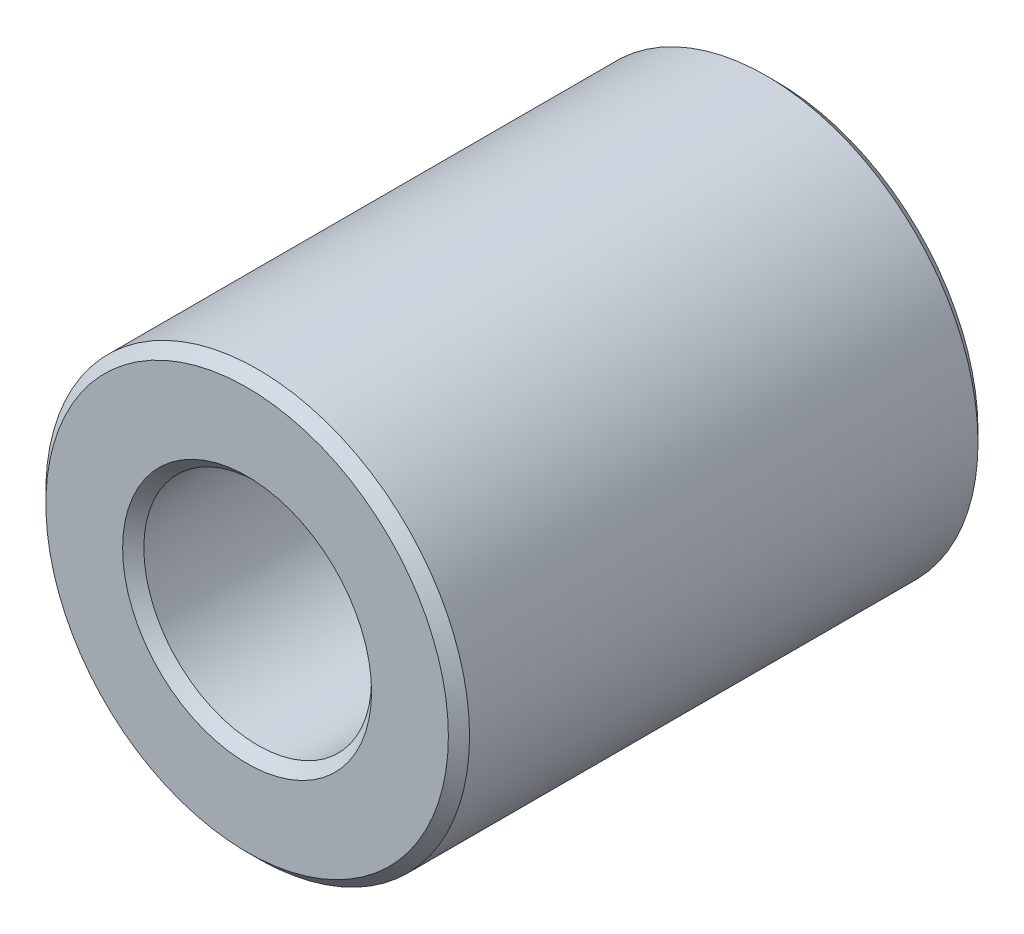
ISO-10303-21;
HEADER;
FILE_DESCRIPTION(('STEP AP214'),'2;1');
FILE_NAME('part.step','',(''),(''),'','','');
FILE_SCHEMA(('AUTOMOTIVE_DESIGN { 1 0 10303 214 1 1 1 1 }'));
ENDSEC;
DATA;
#1=APPLICATION_CONTEXT('core data for automotive mechanical design processes');
#2=APPLICATION_PROTOCOL_DEFINITION('international standard','automotive_design',2000,#1);
#3=PRODUCT_CONTEXT('',#1,'mechanical');
#4=PRODUCT('Part','Part','',(#3));
#5=PRODUCT_RELATED_PRODUCT_CATEGORY('part','',(#4));
#6=PRODUCT_DEFINITION_FORMATION('','',#4);
#7=PRODUCT_DEFINITION_CONTEXT('part definition',#1,'design');
#8=PRODUCT_DEFINITION('design','',#6,#7);
#9=PRODUCT_DEFINITION_SHAPE('','',#8);
#10=(LENGTH_UNIT() NAMED_UNIT(*) SI_UNIT(.MILLI.,.METRE.));
#11=(NAMED_UNIT(*) PLANE_ANGLE_UNIT() SI_UNIT($,.RADIAN.));
#12=(NAMED_UNIT(*) SI_UNIT($,.STERADIAN.) SOLID_ANGLE_UNIT());
#13=UNCERTAINTY_MEASURE_WITH_UNIT(LENGTH_MEASURE(1.E-05),#10,'distance_accuracy_value','');
#14=(GEOMETRIC_REPRESENTATION_CONTEXT(3) GLOBAL_UNCERTAINTY_ASSIGNED_CONTEXT((#13)) GLOBAL_UNIT_ASSIGNED_CONTEXT((#10,
#11,#12)) REPRESENTATION_CONTEXT('',''));
#15=CARTESIAN_POINT('',(0.,0.,0.));
#16=DIRECTION('',(0.,0.,1.));
#17=DIRECTION('',(1.,0.,0.));
#18=AXIS2_PLACEMENT_3D('',#15,#16,#17);
#19=CARTESIAN_POINT('',(0.,0.,5.));
#20=DIRECTION('',(0.,0.,1.));
#21=DIRECTION('',(1.,0.,0.));
#22=AXIS2_PLACEMENT_3D('',#19,#20,#21);
#23=PLANE('',#22);
#24=CARTESIAN_POINT('',(0.,0.,5.));
#25=DIRECTION('',(0.,0.,1.));
#26=DIRECTION('',(1.,0.,0.));
#27=AXIS2_PLACEMENT_3D('',#24,#25,#26);
#28=CIRCLE('',#27,2.35);
#29=CARTESIAN_POINT('',(2.35,0.,5.));
#30=VERTEX_POINT('',#29);
#31=EDGE_CURVE('E10',#30,#30,#28,.F.);
#32=ORIENTED_EDGE('',*,*,#31,.T.);
#33=EDGE_LOOP('',(#32));
#34=FACE_BOUND('',#33,.T.);
#35=CARTESIAN_POINT('',(0.,0.,5.));
#36=DIRECTION('',(0.,0.,1.));
#37=DIRECTION('',(1.,0.,0.));
#38=AXIS2_PLACEMENT_3D('',#35,#36,#37);
#39=CIRCLE('',#38,3.8);
#40=CARTESIAN_POINT('',(3.8,0.,5.));
#41=VERTEX_POINT('',#40);
#42=EDGE_CURVE('E45',#41,#41,#39,.T.);
#43=ORIENTED_EDGE('',*,*,#42,.T.);
#44=EDGE_LOOP('',(#43));
#45=FACE_BOUND('',#44,.T.);
#46=ADVANCED_FACE('F37',(#34,#45),#23,.T.);
#47=CARTESIAN_POINT('',(0.,0.,-5.));
#48=DIRECTION('',(0.,0.,1.));
#49=DIRECTION('',(1.,0.,0.));
#50=AXIS2_PLACEMENT_3D('',#47,#48,#49);
#51=PLANE('',#50);
#52=CARTESIAN_POINT('',(0.,0.,-5.));
#53=DIRECTION('',(0.,0.,1.));
#54=DIRECTION('',(1.,0.,0.));
#55=AXIS2_PLACEMENT_3D('',#52,#53,#54);
#56=CIRCLE('',#55,3.79999999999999);
#57=CARTESIAN_POINT('',(3.79999999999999,0.,-5.));
#58=VERTEX_POINT('',#57);
#59=EDGE_CURVE('E64',#58,#58,#56,.F.);
#60=ORIENTED_EDGE('',*,*,#59,.T.);
#61=EDGE_LOOP('',(#60));
#62=FACE_BOUND('',#61,.T.);
#63=CARTESIAN_POINT('',(0.,0.,-5.));
#64=DIRECTION('',(0.,0.,1.));
#65=DIRECTION('',(1.,0.,0.));
#66=AXIS2_PLACEMENT_3D('',#63,#64,#65);
#67=CIRCLE('',#66,2.35);
#68=CARTESIAN_POINT('',(2.35,0.,-5.));
#69=VERTEX_POINT('',#68);
#70=EDGE_CURVE('E67',#69,#69,#67,.T.);
#71=ORIENTED_EDGE('',*,*,#70,.T.);
#72=EDGE_LOOP('',(#71));
#73=FACE_BOUND('',#72,.T.);
#74=ADVANCED_FACE('F89',(#62,#73),#51,.F.);
#75=CARTESIAN_POINT('',(0.,0.,5.));
#76=DIRECTION('',(0.,0.,-1.));
#77=DIRECTION('',(-1.,0.,0.));
#78=AXIS2_PLACEMENT_3D('',#75,#76,#77);
#79=CYLINDRICAL_SURFACE('',#78,4.);
#80=CARTESIAN_POINT('',(0.,0.,-4.8));
#81=DIRECTION('',(0.,0.,1.));
#82=DIRECTION('',(1.,0.,0.));
#83=AXIS2_PLACEMENT_3D('',#80,#81,#82);
#84=CIRCLE('',#83,4.);
#85=CARTESIAN_POINT('',(4.,0.,-4.8));
#86=VERTEX_POINT('',#85);
#87=EDGE_CURVE('E71',#86,#86,#84,.T.);
#88=ORIENTED_EDGE('',*,*,#87,.T.);
#89=EDGE_LOOP('',(#88));
#90=FACE_BOUND('',#89,.T.);
#91=CARTESIAN_POINT('',(0.,0.,4.8));
#92=DIRECTION('',(0.,0.,1.));
#93=DIRECTION('',(1.,0.,0.));
#94=AXIS2_PLACEMENT_3D('',#91,#92,#93);
#95=CIRCLE('',#94,4.);
#96=CARTESIAN_POINT('',(4.,0.,4.8));
#97=VERTEX_POINT('',#96);
#98=EDGE_CURVE('E74',#97,#97,#95,.F.);
#99=ORIENTED_EDGE('',*,*,#98,.T.);
#100=EDGE_LOOP('',(#99));
#101=FACE_BOUND('',#100,.T.);
#102=ADVANCED_FACE('F78',(#90,#101),#79,.T.);
#103=CARTESIAN_POINT('',(0.,0.,5.));
#104=DIRECTION('',(0.,0.,-1.));
#105=DIRECTION('',(-1.,0.,0.));
#106=AXIS2_PLACEMENT_3D('',#103,#104,#105);
#107=CYLINDRICAL_SURFACE('',#106,2.15);
#108=CARTESIAN_POINT('',(0.,0.,-4.8));
#109=DIRECTION('',(0.,0.,1.));
#110=DIRECTION('',(1.,0.,0.));
#111=AXIS2_PLACEMENT_3D('',#108,#109,#110);
#112=CIRCLE('',#111,2.15);
#113=CARTESIAN_POINT('',(2.15,0.,-4.8));
#114=VERTEX_POINT('',#113);
#115=EDGE_CURVE('E51',#114,#114,#112,.F.);
#116=ORIENTED_EDGE('',*,*,#115,.T.);
#117=EDGE_LOOP('',(#116));
#118=FACE_BOUND('',#117,.T.);
#119=CARTESIAN_POINT('',(0.,0.,4.8));
#120=DIRECTION('',(0.,0.,1.));
#121=DIRECTION('',(1.,0.,0.));
#122=AXIS2_PLACEMENT_3D('',#119,#120,#121);
#123=CIRCLE('',#122,2.15);
#124=CARTESIAN_POINT('',(2.15,0.,4.8));
#125=VERTEX_POINT('',#124);
#126=EDGE_CURVE('E58',#125,#125,#123,.T.);
#127=ORIENTED_EDGE('',*,*,#126,.T.);
#128=EDGE_LOOP('',(#127));
#129=FACE_BOUND('',#128,.T.);
#130=ADVANCED_FACE('F97',(#118,#129),#107,.F.);
#131=CARTESIAN_POINT('',(0.,0.,-4.8));
#132=DIRECTION('',(0.,0.,1.));
#133=DIRECTION('',(1.,0.,0.));
#134=AXIS2_PLACEMENT_3D('',#131,#132,#133);
#135=CONICAL_SURFACE('',#134,4.,0.785398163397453);
#136=ORIENTED_EDGE('',*,*,#59,.F.);
#137=EDGE_LOOP('',(#136));
#138=FACE_BOUND('',#137,.T.);
#139=ORIENTED_EDGE('',*,*,#87,.F.);
#140=EDGE_LOOP('',(#139));
#141=FACE_BOUND('',#140,.T.);
#142=ADVANCED_FACE('F102',(#138,#141),#135,.T.);
#143=CARTESIAN_POINT('',(0.,0.,-5.));
#144=DIRECTION('',(0.,0.,-1.));
#145=DIRECTION('',(-1.,0.,0.));
#146=AXIS2_PLACEMENT_3D('',#143,#144,#145);
#147=CONICAL_SURFACE('',#146,2.35,0.785398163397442);
#148=ORIENTED_EDGE('',*,*,#115,.F.);
#149=EDGE_LOOP('',(#148));
#150=FACE_BOUND('',#149,.T.);
#151=ORIENTED_EDGE('',*,*,#70,.F.);
#152=EDGE_LOOP('',(#151));
#153=FACE_BOUND('',#152,.T.);
#154=ADVANCED_FACE('F86',(#150,#153),#147,.F.);
#155=CARTESIAN_POINT('',(0.,0.,4.8));
#156=DIRECTION('',(0.,0.,1.));
#157=DIRECTION('',(1.,0.,0.));
#158=AXIS2_PLACEMENT_3D('',#155,#156,#157);
#159=CONICAL_SURFACE('',#158,2.15,0.78539816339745);
#160=ORIENTED_EDGE('',*,*,#31,.F.);
#161=EDGE_LOOP('',(#160));
#162=FACE_BOUND('',#161,.T.);
#163=ORIENTED_EDGE('',*,*,#126,.F.);
#164=EDGE_LOOP('',(#163));
#165=FACE_BOUND('',#164,.T.);
#166=ADVANCED_FACE('F82',(#162,#165),#159,.F.);
#167=CARTESIAN_POINT('',(0.,0.,5.));
#168=DIRECTION('',(0.,0.,-1.));
#169=DIRECTION('',(-1.,0.,0.));
#170=AXIS2_PLACEMENT_3D('',#167,#168,#169);
#171=CONICAL_SURFACE('',#170,3.8,0.785398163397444);
#172=ORIENTED_EDGE('',*,*,#98,.F.);
#173=EDGE_LOOP('',(#172));
#174=FACE_BOUND('',#173,.T.);
#175=ORIENTED_EDGE('',*,*,#42,.F.);
#176=EDGE_LOOP('',(#175));
#177=FACE_BOUND('',#176,.T.);
#178=ADVANCED_FACE('F39',(#174,#177),#171,.T.);
#179=CLOSED_SHELL('',(#46,#74,#102,#130,#142,#154,#166,#178));
#180=MANIFOLD_SOLID_BREP('B2',#179);
#181=ADVANCED_BREP_SHAPE_REPRESENTATION('',(#18,#180),#14);
#182=SHAPE_DEFINITION_REPRESENTATION(#9,#181);
ENDSEC;
END-ISO-10303-21;
